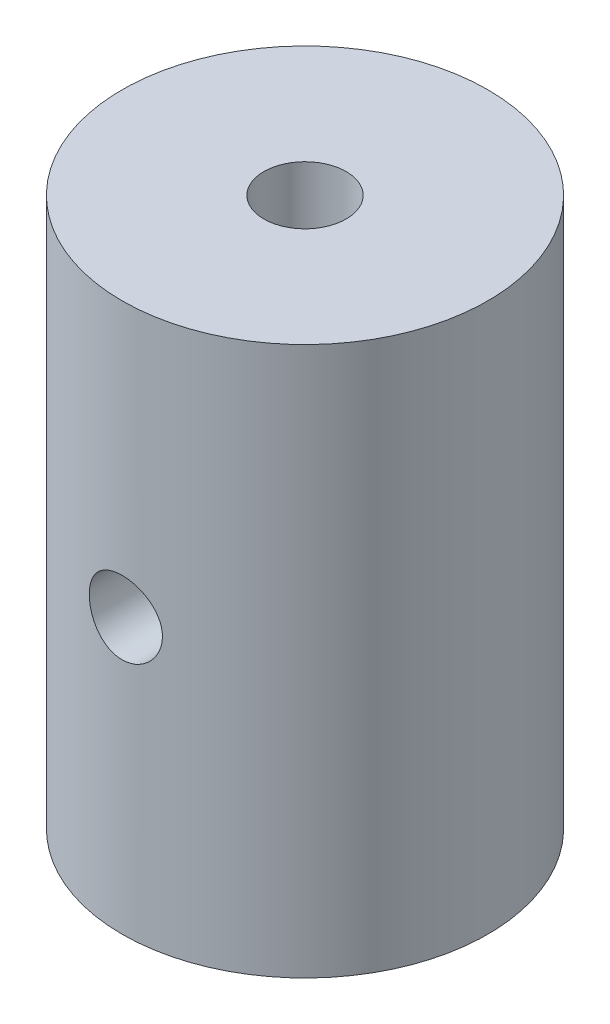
ISO-10303-21;
HEADER;
FILE_DESCRIPTION(('STEP AP214'),'2;1');
FILE_NAME('part.step','',(''),(''),'','','');
FILE_SCHEMA(('AUTOMOTIVE_DESIGN { 1 0 10303 214 1 1 1 1 }'));
ENDSEC;
DATA;
#1=APPLICATION_CONTEXT('core data for automotive mechanical design processes');
#2=APPLICATION_PROTOCOL_DEFINITION('international standard','automotive_design',2000,#1);
#3=PRODUCT_CONTEXT('',#1,'mechanical');
#4=PRODUCT('Part','Part','',(#3));
#5=PRODUCT_RELATED_PRODUCT_CATEGORY('part','',(#4));
#6=PRODUCT_DEFINITION_FORMATION('','',#4);
#7=PRODUCT_DEFINITION_CONTEXT('part definition',#1,'design');
#8=PRODUCT_DEFINITION('design','',#6,#7);
#9=PRODUCT_DEFINITION_SHAPE('','',#8);
#10=(LENGTH_UNIT() NAMED_UNIT(*) SI_UNIT(.MILLI.,.METRE.));
#11=(NAMED_UNIT(*) PLANE_ANGLE_UNIT() SI_UNIT($,.RADIAN.));
#12=(NAMED_UNIT(*) SI_UNIT($,.STERADIAN.) SOLID_ANGLE_UNIT());
#13=UNCERTAINTY_MEASURE_WITH_UNIT(LENGTH_MEASURE(1.E-05),#10,'distance_accuracy_value','');
#14=(GEOMETRIC_REPRESENTATION_CONTEXT(3) GLOBAL_UNCERTAINTY_ASSIGNED_CONTEXT((#13)) GLOBAL_UNIT_ASSIGNED_CONTEXT((#10,
#11,#12)) REPRESENTATION_CONTEXT('',''));
#15=CARTESIAN_POINT('',(0.,0.,0.));
#16=DIRECTION('',(0.,0.,1.));
#17=DIRECTION('',(1.,0.,0.));
#18=AXIS2_PLACEMENT_3D('',#15,#16,#17);
#19=CARTESIAN_POINT('',(0.,30.,0.));
#20=DIRECTION('',(0.,-1.,0.));
#21=DIRECTION('',(0.,0.,-1.));
#22=AXIS2_PLACEMENT_3D('',#19,#20,#21);
#23=CYLINDRICAL_SURFACE('',#22,10.);
#24=CARTESIAN_POINT('',(0.,16.65,-10.));
#25=CARTESIAN_POINT('',(-0.0920114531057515,16.6499962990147,-9.99999843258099));
#26=CARTESIAN_POINT('',(-0.184073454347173,16.6422775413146,-9.99871684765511));
#27=CARTESIAN_POINT('',(-0.36561632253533,16.6116187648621,-9.99372775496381));
#28=CARTESIAN_POINT('',(-0.455094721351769,16.5886646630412,-9.9900180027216));
#29=CARTESIAN_POINT('',(-0.628817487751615,16.5282463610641,-9.98058875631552));
#30=CARTESIAN_POINT('',(-0.713066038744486,16.4907939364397,-9.974870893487));
#31=CARTESIAN_POINT('',(-0.874072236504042,16.4024727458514,-9.96205444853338));
#32=CARTESIAN_POINT('',(-0.950830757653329,16.351605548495,-9.95495602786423));
#33=CARTESIAN_POINT('',(-1.09540879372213,16.2373912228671,-9.94009120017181));
#34=CARTESIAN_POINT('',(-1.16314787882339,16.1739429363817,-9.93231968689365));
#35=CARTESIAN_POINT('',(-1.28706950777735,16.0365852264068,-9.9170237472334));
#36=CARTESIAN_POINT('',(-1.34325132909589,15.9626751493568,-9.90949933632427));
#37=CARTESIAN_POINT('',(-1.44278500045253,15.8059406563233,-9.89550007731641));
#38=CARTESIAN_POINT('',(-1.48605749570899,15.7230652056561,-9.88903182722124));
#39=CARTESIAN_POINT('',(-1.55803674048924,15.5510973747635,-9.87794796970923));
#40=CARTESIAN_POINT('',(-1.58674445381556,15.4620054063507,-9.8733322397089));
#41=CARTESIAN_POINT('',(-1.6285261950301,15.280985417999,-9.86652679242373));
#42=CARTESIAN_POINT('',(-1.64173895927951,15.1890902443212,-9.86431555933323));
#43=CARTESIAN_POINT('',(-1.65258585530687,15.0043626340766,-9.86250435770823));
#44=CARTESIAN_POINT('',(-1.6502210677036,14.9115302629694,-9.86290420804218));
#45=CARTESIAN_POINT('',(-1.63009303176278,14.7285527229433,-9.86625034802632));
#46=CARTESIAN_POINT('',(-1.61248549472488,14.6383898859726,-9.86917088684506));
#47=CARTESIAN_POINT('',(-1.5626160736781,14.4623159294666,-9.87718903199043));
#48=CARTESIAN_POINT('',(-1.53035369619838,14.3764049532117,-9.88228671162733));
#49=CARTESIAN_POINT('',(-1.45193210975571,14.2108064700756,-9.89411264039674));
#50=CARTESIAN_POINT('',(-1.4057081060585,14.1311502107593,-9.90084846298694));
#51=CARTESIAN_POINT('',(-1.30072141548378,13.9806656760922,-9.9151864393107));
#52=CARTESIAN_POINT('',(-1.24195773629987,13.9098381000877,-9.92278866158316));
#53=CARTESIAN_POINT('',(-1.11271072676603,13.7781200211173,-9.93811607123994));
#54=CARTESIAN_POINT('',(-1.04209376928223,13.71736060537,-9.94584163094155));
#55=CARTESIAN_POINT('',(-0.891597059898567,13.6085339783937,-9.96045987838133));
#56=CARTESIAN_POINT('',(-0.811717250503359,13.5604668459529,-9.9673525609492));
#57=CARTESIAN_POINT('',(-0.644840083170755,13.4783778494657,-9.97953794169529));
#58=CARTESIAN_POINT('',(-0.55783700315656,13.444367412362,-9.98482933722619));
#59=CARTESIAN_POINT('',(-0.379246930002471,13.3914780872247,-9.99320544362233));
#60=CARTESIAN_POINT('',(-0.287660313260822,13.3725979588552,-9.99629033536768));
#61=CARTESIAN_POINT('',(-0.103632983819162,13.3506825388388,-9.99988156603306));
#62=CARTESIAN_POINT('',(-0.0112142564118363,13.3474672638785,-10.0004171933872));
#63=CARTESIAN_POINT('',(0.172841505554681,13.3564931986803,-9.99892971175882));
#64=CARTESIAN_POINT('',(0.264478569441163,13.3687338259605,-9.99690669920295));
#65=CARTESIAN_POINT('',(0.443814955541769,13.4081744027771,-9.99054737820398));
#66=CARTESIAN_POINT('',(0.531534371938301,13.4352853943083,-9.98622483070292));
#67=CARTESIAN_POINT('',(0.701182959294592,13.5036023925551,-9.97574921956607));
#68=CARTESIAN_POINT('',(0.783111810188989,13.5448091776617,-9.96959605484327));
#69=CARTESIAN_POINT('',(0.939636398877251,13.640561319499,-9.95606928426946));
#70=CARTESIAN_POINT('',(1.01416235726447,13.6952192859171,-9.94868555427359));
#71=CARTESIAN_POINT('',(1.15304841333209,13.8161671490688,-9.93354765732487));
#72=CARTESIAN_POINT('',(1.21740778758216,13.8824578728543,-9.92579346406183));
#73=CARTESIAN_POINT('',(1.33479962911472,14.0255961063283,-9.91069407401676));
#74=CARTESIAN_POINT('',(1.38771058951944,14.1025438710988,-9.90335382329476));
#75=CARTESIAN_POINT('',(1.47985547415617,14.2643410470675,-9.89000528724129));
#76=CARTESIAN_POINT('',(1.51908982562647,14.3491902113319,-9.88399696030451));
#77=CARTESIAN_POINT('',(1.58258535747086,14.5240395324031,-9.87402953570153));
#78=CARTESIAN_POINT('',(1.60690737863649,14.6140170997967,-9.87006212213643));
#79=CARTESIAN_POINT('',(1.64007952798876,14.7968513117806,-9.86460473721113));
#80=CARTESIAN_POINT('',(1.64893097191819,14.8897077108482,-9.86311455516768));
#81=CARTESIAN_POINT('',(1.65087457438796,15.0744506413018,-9.86278931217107));
#82=CARTESIAN_POINT('',(1.64415796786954,15.1663351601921,-9.86392203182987));
#83=CARTESIAN_POINT('',(1.61556925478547,15.3476477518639,-9.86864441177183));
#84=CARTESIAN_POINT('',(1.59369719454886,15.4370758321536,-9.87223406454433));
#85=CARTESIAN_POINT('',(1.53549112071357,15.6108652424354,-9.88145370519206));
#86=CARTESIAN_POINT('',(1.49917324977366,15.695232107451,-9.88708141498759));
#87=CARTESIAN_POINT('',(1.41312606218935,15.8567062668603,-9.89974533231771));
#88=CARTESIAN_POINT('',(1.36339610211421,15.9338132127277,-9.90678160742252));
#89=CARTESIAN_POINT('',(1.25125259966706,16.0795454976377,-9.92157214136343));
#90=CARTESIAN_POINT('',(1.18869826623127,16.1480617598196,-9.92933379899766));
#91=CARTESIAN_POINT('',(1.0529786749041,16.2736905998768,-9.94464125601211));
#92=CARTESIAN_POINT('',(0.979810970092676,16.3308005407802,-9.95218700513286));
#93=CARTESIAN_POINT('',(0.824354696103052,16.4323474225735,-9.96627143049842));
#94=CARTESIAN_POINT('',(0.742007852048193,16.476696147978,-9.97280295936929));
#95=CARTESIAN_POINT('',(0.5709595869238,16.5508633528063,-9.98405342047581));
#96=CARTESIAN_POINT('',(0.482264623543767,16.5806963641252,-9.98877416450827));
#97=CARTESIAN_POINT('',(0.327682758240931,16.6184793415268,-9.99483601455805));
#98=CARTESIAN_POINT('',(0.262733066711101,16.6302807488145,-9.99676220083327));
#99=CARTESIAN_POINT('',(0.131864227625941,16.6460423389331,-9.99934474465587));
#100=CARTESIAN_POINT('',(0.0659450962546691,16.6500026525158,-10.0000011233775));
#101=CARTESIAN_POINT('',(0.,16.65,-10.));
#102=B_SPLINE_CURVE_WITH_KNOTS('',3,(#24,#25,#26,#27,#28,#29,#30,#31,#32,#33,#34,#35,#36,#37,
#38,#39,#40,#41,#42,#43,#44,#45,#46,#47,#48,#49,#50,#51,#52,#53,#54,#55,#56,#57,#58,#59,#60,#61,
#62,#63,#64,#65,#66,#67,#68,#69,#70,#71,#72,#73,#74,#75,#76,#77,#78,#79,#80,#81,#82,#83,#84,#85,
#86,#87,#88,#89,#90,#91,#92,#93,#94,#95,#96,#97,#98,#99,#100,#101),.UNSPECIFIED.,.T.,.F.,(4,2,2,
2,2,2,2,2,2,2,2,2,2,2,2,2,2,2,2,2,2,2,2,2,2,2,2,2,2,2,2,2,2,2,2,2,2,2,4),(0.,0.275793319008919,
0.551841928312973,0.827666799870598,1.10345943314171,1.38156673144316,1.65969141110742,
1.93949209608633,2.21927426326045,2.49653175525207,2.7737700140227,3.04820914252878,
3.32265751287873,3.59839967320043,3.87416366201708,4.15327572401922,4.43238951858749,
4.71172976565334,4.99104711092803,5.26714751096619,5.54323750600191,5.81769359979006,
6.09216485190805,6.36901711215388,6.6458890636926,6.92556925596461,7.2052407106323,
7.48376340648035,7.76226241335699,8.03735855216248,8.31245385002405,8.58724259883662,
8.86204453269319,9.1400425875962,9.41810483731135,9.69804546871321,9.97770526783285,
10.1753710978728,10.3730336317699),.UNSPECIFIED.);
#103=CARTESIAN_POINT('',(0.,16.65,-10.));
#104=VERTEX_POINT('',#103);
#105=EDGE_CURVE('E58',#104,#104,#102,.T.);
#106=ORIENTED_EDGE('',*,*,#105,.T.);
#107=EDGE_LOOP('',(#106));
#108=FACE_BOUND('',#107,.T.);
#109=CARTESIAN_POINT('',(0.,0.,0.));
#110=DIRECTION('',(0.,1.,0.));
#111=DIRECTION('',(0.,0.,1.));
#112=AXIS2_PLACEMENT_3D('',#109,#110,#111);
#113=CIRCLE('',#112,10.);
#114=CARTESIAN_POINT('',(0.,0.,10.));
#115=VERTEX_POINT('',#114);
#116=EDGE_CURVE('E44',#115,#115,#113,.T.);
#117=ORIENTED_EDGE('',*,*,#116,.T.);
#118=EDGE_LOOP('',(#117));
#119=FACE_BOUND('',#118,.T.);
#120=CARTESIAN_POINT('',(0.,30.,0.));
#121=DIRECTION('',(0.,1.,0.));
#122=DIRECTION('',(0.,0.,1.));
#123=AXIS2_PLACEMENT_3D('',#120,#121,#122);
#124=CIRCLE('',#123,10.);
#125=CARTESIAN_POINT('',(0.,30.,10.));
#126=VERTEX_POINT('',#125);
#127=EDGE_CURVE('E10',#126,#126,#124,.T.);
#128=ORIENTED_EDGE('',*,*,#127,.F.);
#129=EDGE_LOOP('',(#128));
#130=FACE_BOUND('',#129,.T.);
#131=CARTESIAN_POINT('',(-2.,15.,9.79795897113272));
#132=CARTESIAN_POINT('',(-1.99999589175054,14.8888712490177,9.79796118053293));
#133=CARTESIAN_POINT('',(-1.99070634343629,14.7776907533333,9.79987016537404));
#134=CARTESIAN_POINT('',(-1.95382456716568,14.5584749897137,9.8072886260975));
#135=CARTESIAN_POINT('',(-1.92621769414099,14.450442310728,9.81280098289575));
#136=CARTESIAN_POINT('',(-1.85359156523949,14.2407253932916,9.82677747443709));
#137=CARTESIAN_POINT('',(-1.80858962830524,14.1390349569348,9.83523867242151));
#138=CARTESIAN_POINT('',(-1.70249821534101,13.9446503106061,9.85415598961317));
#139=CARTESIAN_POINT('',(-1.6414096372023,13.8519555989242,9.86461199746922));
#140=CARTESIAN_POINT('',(-1.50395815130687,13.6768779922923,9.88650599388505));
#141=CARTESIAN_POINT('',(-1.42741131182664,13.5946408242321,9.89795475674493));
#142=CARTESIAN_POINT('',(-1.26161357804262,13.444084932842,9.92044944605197));
#143=CARTESIAN_POINT('',(-1.17236179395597,13.3757671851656,9.93149534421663));
#144=CARTESIAN_POINT('',(-0.982722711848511,13.2544239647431,9.95205592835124));
#145=CARTESIAN_POINT('',(-0.882245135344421,13.2015369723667,9.96155642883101));
#146=CARTESIAN_POINT('',(-0.673608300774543,13.1134501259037,9.97783473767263));
#147=CARTESIAN_POINT('',(-0.565449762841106,13.078248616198,9.98461280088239));
#148=CARTESIAN_POINT('',(-0.346033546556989,13.0269856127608,9.99460641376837));
#149=CARTESIAN_POINT('',(-0.234835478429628,13.010678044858,9.99786772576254));
#150=CARTESIAN_POINT('',(-0.0112371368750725,12.9968980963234,10.0006184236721));
#151=CARTESIAN_POINT('',(0.101163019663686,12.9994239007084,10.0001081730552));
#152=CARTESIAN_POINT('',(0.322284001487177,13.0230523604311,9.99540869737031));
#153=CARTESIAN_POINT('',(0.43103442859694,13.0438899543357,9.99127196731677));
#154=CARTESIAN_POINT('',(0.643463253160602,13.1031300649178,9.97984354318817));
#155=CARTESIAN_POINT('',(0.747141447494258,13.1415332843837,9.97255172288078));
#156=CARTESIAN_POINT('',(0.947238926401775,13.2350600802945,9.95554592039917));
#157=CARTESIAN_POINT('',(1.0436083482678,13.2902875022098,9.94581696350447));
#158=CARTESIAN_POINT('',(1.22581009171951,13.4158181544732,9.92500938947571));
#159=CARTESIAN_POINT('',(1.31164119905,13.486123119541,9.91393061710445));
#160=CARTESIAN_POINT('',(1.47190286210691,13.6412672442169,9.89141928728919));
#161=CARTESIAN_POINT('',(1.54610863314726,13.7263383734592,9.87998392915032));
#162=CARTESIAN_POINT('',(1.67923698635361,13.9078328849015,9.85823143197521));
#163=CARTESIAN_POINT('',(1.7381592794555,14.0042564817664,9.84791431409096));
#164=CARTESIAN_POINT('',(1.83912562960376,14.2060416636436,9.82956094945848));
#165=CARTESIAN_POINT('',(1.88113329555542,14.3114219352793,9.82152963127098));
#166=CARTESIAN_POINT('',(1.94678068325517,14.527942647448,9.80872952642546));
#167=CARTESIAN_POINT('',(1.97042279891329,14.6390823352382,9.80396031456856));
#168=CARTESIAN_POINT('',(1.9983320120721,14.8619297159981,9.79830958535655));
#169=CARTESIAN_POINT('',(2.00292371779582,14.9735951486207,9.79736294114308));
#170=CARTESIAN_POINT('',(1.99347525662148,15.1960964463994,9.79928971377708));
#171=CARTESIAN_POINT('',(1.97943614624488,15.3069323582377,9.80216291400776));
#172=CARTESIAN_POINT('',(1.93340441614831,15.5235372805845,9.8113446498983));
#173=CARTESIAN_POINT('',(1.9015852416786,15.6293446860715,9.81761998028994));
#174=CARTESIAN_POINT('',(1.82108207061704,15.8341265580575,9.8328697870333));
#175=CARTESIAN_POINT('',(1.77239668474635,15.9331004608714,9.84184448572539));
#176=CARTESIAN_POINT('',(1.6588082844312,16.1228262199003,9.86162811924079));
#177=CARTESIAN_POINT('',(1.59370215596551,16.2134540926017,9.87245943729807));
#178=CARTESIAN_POINT('',(1.44939114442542,16.3826166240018,9.89467447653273));
#179=CARTESIAN_POINT('',(1.37018481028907,16.4611500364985,9.90605825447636));
#180=CARTESIAN_POINT('',(1.19846454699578,16.6051251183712,9.92830691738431));
#181=CARTESIAN_POINT('',(1.10576499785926,16.6703473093,9.93916115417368));
#182=CARTESIAN_POINT('',(0.910535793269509,16.7842917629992,9.9589425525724));
#183=CARTESIAN_POINT('',(0.808006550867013,16.8330147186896,9.96786979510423));
#184=CARTESIAN_POINT('',(0.596605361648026,16.9122577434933,9.98274588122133));
#185=CARTESIAN_POINT('',(0.487773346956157,16.9428810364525,9.98871158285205));
#186=CARTESIAN_POINT('',(0.266378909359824,16.9853824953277,9.99706471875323));
#187=CARTESIAN_POINT('',(0.153816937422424,16.9972629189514,9.99945258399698));
#188=CARTESIAN_POINT('',(-0.0697457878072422,17.0018539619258,10.0003708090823));
#189=CARTESIAN_POINT('',(-0.180739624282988,16.9948945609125,9.99896757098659));
#190=CARTESIAN_POINT('',(-0.3999420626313,16.9627320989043,9.99260087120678));
#191=CARTESIAN_POINT('',(-0.508150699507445,16.9375292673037,9.98763745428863));
#192=CARTESIAN_POINT('',(-0.71850549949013,16.8697420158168,9.97470996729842));
#193=CARTESIAN_POINT('',(-0.820664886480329,16.827197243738,9.9667527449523));
#194=CARTESIAN_POINT('',(-1.01644244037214,16.7259755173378,9.9486944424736));
#195=CARTESIAN_POINT('',(-1.11005993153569,16.667297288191,9.93859319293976));
#196=CARTESIAN_POINT('',(-1.28772778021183,16.5343612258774,9.91715198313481));
#197=CARTESIAN_POINT('',(-1.37159943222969,16.4598673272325,9.90579466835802));
#198=CARTESIAN_POINT('',(-1.52576523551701,16.2978995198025,9.8832244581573));
#199=CARTESIAN_POINT('',(-1.59605616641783,16.2104225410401,9.87201159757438));
#200=CARTESIAN_POINT('',(-1.72178443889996,16.0238413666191,9.85086685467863));
#201=CARTESIAN_POINT('',(-1.77705362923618,15.9246220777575,9.84095007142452));
#202=CARTESIAN_POINT('',(-1.87004809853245,15.7181344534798,9.82370474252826));
#203=CARTESIAN_POINT('',(-1.90778929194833,15.6108735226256,9.81637385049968));
#204=CARTESIAN_POINT('',(-1.95733827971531,15.4194750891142,9.8065936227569));
#205=CARTESIAN_POINT('',(-1.97330779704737,15.3364291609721,9.80337569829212));
#206=CARTESIAN_POINT('',(-1.99464003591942,15.1689320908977,9.79905756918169));
#207=CARTESIAN_POINT('',(-2.00000312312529,15.0844809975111,9.79795729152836));
#208=CARTESIAN_POINT('',(-2.,15.,9.79795897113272));
#209=B_SPLINE_CURVE_WITH_KNOTS('',3,(#131,#132,#133,#134,#135,#136,#137,#138,#139,#140,#141,
#142,#143,#144,#145,#146,#147,#148,#149,#150,#151,#152,#153,#154,#155,#156,#157,#158,#159,#160,
#161,#162,#163,#164,#165,#166,#167,#168,#169,#170,#171,#172,#173,#174,#175,#176,#177,#178,#179,
#180,#181,#182,#183,#184,#185,#186,#187,#188,#189,#190,#191,#192,#193,#194,#195,#196,#197,#198,
#199,#200,#201,#202,#203,#204,#205,#206,#207,#208),.UNSPECIFIED.,.T.,.F.,(4,2,2,2,2,2,2,2,2,2,2,
2,2,2,2,2,2,2,2,2,2,2,2,2,2,2,2,2,2,2,2,2,2,2,2,2,2,2,4),(0.,0.333076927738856,
0.666420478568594,0.999432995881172,1.33242692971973,1.66964505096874,2.00688680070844,
2.347068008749,2.6872173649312,3.02288497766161,3.35852024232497,3.68937579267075,
4.02024458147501,4.35319848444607,4.68619071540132,5.02498693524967,5.36378956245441,
5.70331726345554,6.0428007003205,6.37647515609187,6.71013069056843,7.04058683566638,
7.37107020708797,7.70586119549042,8.04068665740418,8.38065203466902,8.7206031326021,
9.05859627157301,9.39654869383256,9.72862034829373,10.0606878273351,10.392000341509,
10.7233390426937,11.0600230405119,11.3967867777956,11.7371779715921,12.077259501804,
12.3304760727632,12.5836839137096),.UNSPECIFIED.);
#210=CARTESIAN_POINT('',(-2.,15.,9.79795897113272));
#211=VERTEX_POINT('',#210);
#212=EDGE_CURVE('E57',#211,#211,#209,.T.);
#213=ORIENTED_EDGE('',*,*,#212,.F.);
#214=EDGE_LOOP('',(#213));
#215=FACE_BOUND('',#214,.T.);
#216=ADVANCED_FACE('F32',(#108,#119,#130,#215),#23,.T.);
#217=CARTESIAN_POINT('',(0.,30.,0.));
#218=DIRECTION('',(0.,-1.,0.));
#219=DIRECTION('',(0.,0.,-1.));
#220=AXIS2_PLACEMENT_3D('',#217,#218,#219);
#221=CYLINDRICAL_SURFACE('',#220,2.25);
#222=CARTESIAN_POINT('',(0.,16.65,-2.25));
#223=CARTESIAN_POINT('',(-0.0809906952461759,16.6499947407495,-2.24999497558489));
#224=CARTESIAN_POINT('',(-0.162113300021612,16.6439889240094,-2.24558051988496));
#225=CARTESIAN_POINT('',(-0.321821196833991,16.6203345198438,-2.22832242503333));
#226=CARTESIAN_POINT('',(-0.40039958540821,16.6026566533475,-2.21545758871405));
#227=CARTESIAN_POINT('',(-0.552282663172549,16.5568364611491,-2.18254158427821));
#228=CARTESIAN_POINT('',(-0.625615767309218,16.5287565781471,-2.16253332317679));
#229=CARTESIAN_POINT('',(-0.766073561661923,16.4634333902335,-2.11685925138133));
#230=CARTESIAN_POINT('',(-0.83320009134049,16.4261928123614,-2.09119512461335));
#231=CARTESIAN_POINT('',(-0.966336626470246,16.339980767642,-2.03333001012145));
#232=CARTESIAN_POINT('',(-1.03168378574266,16.2902481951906,-2.00074594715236));
#233=CARTESIAN_POINT('',(-1.1536800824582,16.1824395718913,-1.93297808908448));
#234=CARTESIAN_POINT('',(-1.21031529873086,16.1243504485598,-1.89779026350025));
#235=CARTESIAN_POINT('',(-1.32459682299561,15.9885794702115,-1.82032286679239));
#236=CARTESIAN_POINT('',(-1.38030211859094,15.9092836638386,-1.77799359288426));
#237=CARTESIAN_POINT('',(-1.47774307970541,15.7404368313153,-1.69786280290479));
#238=CARTESIAN_POINT('',(-1.51949951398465,15.650901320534,-1.66005460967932));
#239=CARTESIAN_POINT('',(-1.57581948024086,15.4937054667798,-1.60632390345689));
#240=CARTESIAN_POINT('',(-1.59480769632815,15.4287025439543,-1.58730714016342));
#241=CARTESIAN_POINT('',(-1.62479877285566,15.2952686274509,-1.556597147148));
#242=CARTESIAN_POINT('',(-1.63581957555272,15.2268457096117,-1.5448874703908));
#243=CARTESIAN_POINT('',(-1.64916354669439,15.087615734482,-1.53064273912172));
#244=CARTESIAN_POINT('',(-1.65141915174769,15.0167943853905,-1.52817895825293));
#245=CARTESIAN_POINT('',(-1.64683173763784,14.8757761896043,-1.53311832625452));
#246=CARTESIAN_POINT('',(-1.63998250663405,14.805579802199,-1.54052821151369));
#247=CARTESIAN_POINT('',(-1.61656395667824,14.6605997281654,-1.56509666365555));
#248=CARTESIAN_POINT('',(-1.59901909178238,14.5861466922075,-1.58322726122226));
#249=CARTESIAN_POINT('',(-1.55470669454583,14.442249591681,-1.62675928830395));
#250=CARTESIAN_POINT('',(-1.52791741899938,14.3728178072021,-1.6521778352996));
#251=CARTESIAN_POINT('',(-1.45534248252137,14.2162162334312,-1.71685192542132));
#252=CARTESIAN_POINT('',(-1.40618988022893,14.1313305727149,-1.75783830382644));
#253=CARTESIAN_POINT('',(-1.2943473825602,13.9720675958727,-1.84175869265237));
#254=CARTESIAN_POINT('',(-1.23164206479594,13.8977024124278,-1.88469487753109));
#255=CARTESIAN_POINT('',(-1.09236217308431,13.7594348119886,-1.96874589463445));
#256=CARTESIAN_POINT('',(-1.01560526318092,13.6956939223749,-2.00982669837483));
#257=CARTESIAN_POINT('',(-0.849681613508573,13.5820450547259,-2.08537843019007));
#258=CARTESIAN_POINT('',(-0.760543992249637,13.5321054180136,-2.11986442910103));
#259=CARTESIAN_POINT('',(-0.59589989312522,13.4594473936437,-2.17090376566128));
#260=CARTESIAN_POINT('',(-0.522743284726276,13.4330333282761,-2.18978777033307));
#261=CARTESIAN_POINT('',(-0.372031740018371,13.3905885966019,-2.22035708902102));
#262=CARTESIAN_POINT('',(-0.294480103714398,13.3745502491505,-2.23204772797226));
#263=CARTESIAN_POINT('',(-0.136757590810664,13.3537477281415,-2.24724173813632));
#264=CARTESIAN_POINT('',(-0.0565777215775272,13.3490275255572,-2.25071317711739));
#265=CARTESIAN_POINT('',(0.103527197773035,13.351306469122,-2.24904189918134));
#266=CARTESIAN_POINT('',(0.183452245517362,13.3583057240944,-2.24389910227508));
#267=CARTESIAN_POINT('',(0.335727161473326,13.3827872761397,-2.22605327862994));
#268=CARTESIAN_POINT('',(0.408242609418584,13.3996087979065,-2.21382714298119));
#269=CARTESIAN_POINT('',(0.549140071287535,13.4423192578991,-2.18315118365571));
#270=CARTESIAN_POINT('',(0.617521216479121,13.4682100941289,-2.16470005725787));
#271=CARTESIAN_POINT('',(0.754234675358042,13.5304036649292,-2.12112731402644));
#272=CARTESIAN_POINT('',(0.822129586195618,13.5673712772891,-2.09559155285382));
#273=CARTESIAN_POINT('',(0.950949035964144,13.6494305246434,-2.04037172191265));
#274=CARTESIAN_POINT('',(1.01186922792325,13.6945271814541,-2.01068509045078));
#275=CARTESIAN_POINT('',(1.13679320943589,13.8007890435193,-1.94322308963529));
#276=CARTESIAN_POINT('',(1.1993175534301,13.8633844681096,-1.90496217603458));
#277=CARTESIAN_POINT('',(1.31359376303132,13.9976258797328,-1.8280361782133));
#278=CARTESIAN_POINT('',(1.36533563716,14.0692801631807,-1.78937075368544));
#279=CARTESIAN_POINT('',(1.45267281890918,14.2134811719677,-1.71902835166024));
#280=CARTESIAN_POINT('',(1.48937197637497,14.2852044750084,-1.68704009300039));
#281=CARTESIAN_POINT('',(1.55248896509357,14.4353104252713,-1.62914476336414));
#282=CARTESIAN_POINT('',(1.57892817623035,14.5136788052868,-1.60322509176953));
#283=CARTESIAN_POINT('',(1.61533068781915,14.6574160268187,-1.56643591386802));
#284=CARTESIAN_POINT('',(1.62768458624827,14.7216302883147,-1.5534761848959));
#285=CARTESIAN_POINT('',(1.64467218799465,14.8521289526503,-1.53548498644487));
#286=CARTESIAN_POINT('',(1.64931772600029,14.9184100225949,-1.5304413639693));
#287=CARTESIAN_POINT('',(1.65054319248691,15.0512925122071,-1.52912035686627));
#288=CARTESIAN_POINT('',(1.6471045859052,15.1178943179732,-1.53286311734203));
#289=CARTESIAN_POINT('',(1.63240565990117,15.249274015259,-1.54850224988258));
#290=CARTESIAN_POINT('',(1.62113461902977,15.3140492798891,-1.56040979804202));
#291=CARTESIAN_POINT('',(1.58722765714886,15.4584526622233,-1.59497351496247));
#292=CARTESIAN_POINT('',(1.56226024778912,15.5370164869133,-1.61973224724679));
#293=CARTESIAN_POINT('',(1.50206530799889,15.6876912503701,-1.67570533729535));
#294=CARTESIAN_POINT('',(1.4668108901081,15.7597846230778,-1.70693654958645));
#295=CARTESIAN_POINT('',(1.37621669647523,15.9158229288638,-1.78124164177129));
#296=CARTESIAN_POINT('',(1.31802258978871,15.9976760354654,-1.82522955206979));
#297=CARTESIAN_POINT('',(1.18771158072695,16.1497168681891,-1.91259016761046));
#298=CARTESIAN_POINT('',(1.11560276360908,16.2199113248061,-1.95596321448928));
#299=CARTESIAN_POINT('',(0.970486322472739,16.3371352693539,-2.03131946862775));
#300=CARTESIAN_POINT('',(0.899396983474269,16.386071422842,-2.06402180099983));
#301=CARTESIAN_POINT('',(0.748509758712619,16.4730199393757,-2.12338830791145));
#302=CARTESIAN_POINT('',(0.66872093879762,16.5110435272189,-2.15005868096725));
#303=CARTESIAN_POINT('',(0.514488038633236,16.5695720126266,-2.19162068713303));
#304=CARTESIAN_POINT('',(0.441029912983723,16.5918466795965,-2.20767749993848));
#305=CARTESIAN_POINT('',(0.290634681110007,16.6260201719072,-2.23244266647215));
#306=CARTESIAN_POINT('',(0.213707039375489,16.6379456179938,-2.24116987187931));
#307=CARTESIAN_POINT('',(0.113564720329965,16.6462449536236,-2.24724766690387));
#308=CARTESIAN_POINT('',(0.0908909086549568,16.647651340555,-2.24827811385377));
#309=CARTESIAN_POINT('',(0.0454815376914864,16.6495296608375,-2.24965502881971));
#310=CARTESIAN_POINT('',(0.0227459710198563,16.6500014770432,-2.2500014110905));
#311=CARTESIAN_POINT('',(0.,16.65,-2.25));
#312=B_SPLINE_CURVE_WITH_KNOTS('',3,(#222,#223,#224,#225,#226,#227,#228,#229,#230,#231,#232,
#233,#234,#235,#236,#237,#238,#239,#240,#241,#242,#243,#244,#245,#246,#247,#248,#249,#250,#251,
#252,#253,#254,#255,#256,#257,#258,#259,#260,#261,#262,#263,#264,#265,#266,#267,#268,#269,#270,
#271,#272,#273,#274,#275,#276,#277,#278,#279,#280,#281,#282,#283,#284,#285,#286,#287,#288,#289,
#290,#291,#292,#293,#294,#295,#296,#297,#298,#299,#300,#301,#302,#303,#304,#305,#306,#307,#308,
#309,#310,#311),.UNSPECIFIED.,.T.,.F.,(4,2,2,2,2,2,2,2,2,2,2,2,2,2,2,2,2,2,2,2,2,2,2,2,2,2,2,2,
2,2,2,2,2,2,2,2,2,2,2,2,2,2,2,2,4),(0.,0.242872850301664,0.48635726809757,0.728403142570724,
0.970377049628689,1.23446779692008,1.49897625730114,1.81487048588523,2.13029225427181,
2.34056715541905,2.55036703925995,2.76178091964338,2.9733391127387,3.20789113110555,
3.44299862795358,3.76029490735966,4.07795417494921,4.40007264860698,4.72144596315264,
4.96057061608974,5.19951804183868,5.43939228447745,5.67926875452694,5.9046129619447,
6.13000435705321,6.37334189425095,6.61683027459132,6.90492246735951,7.19328044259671,
7.45247037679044,7.71111726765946,7.91028899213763,8.10915464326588,8.30847669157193,
8.50807212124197,8.76487616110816,9.02235752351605,9.34970128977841,9.67685541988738,
9.95264965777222,10.228159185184,10.4624548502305,10.6961460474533,10.7643475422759,
10.8325575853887),.UNSPECIFIED.);
#313=CARTESIAN_POINT('',(0.,16.65,-2.25));
#314=VERTEX_POINT('',#313);
#315=EDGE_CURVE('E36',#314,#314,#312,.T.);
#316=ORIENTED_EDGE('',*,*,#315,.F.);
#317=EDGE_LOOP('',(#316));
#318=FACE_BOUND('',#317,.T.);
#319=CARTESIAN_POINT('',(0.,0.,0.));
#320=DIRECTION('',(0.,1.,0.));
#321=DIRECTION('',(0.,0.,1.));
#322=AXIS2_PLACEMENT_3D('',#319,#320,#321);
#323=CIRCLE('',#322,2.25);
#324=CARTESIAN_POINT('',(0.,0.,2.25));
#325=VERTEX_POINT('',#324);
#326=EDGE_CURVE('E76',#325,#325,#323,.T.);
#327=ORIENTED_EDGE('',*,*,#326,.F.);
#328=EDGE_LOOP('',(#327));
#329=FACE_BOUND('',#328,.T.);
#330=CARTESIAN_POINT('',(0.,30.,0.));
#331=DIRECTION('',(0.,1.,0.));
#332=DIRECTION('',(0.,0.,1.));
#333=AXIS2_PLACEMENT_3D('',#330,#331,#332);
#334=CIRCLE('',#333,2.25);
#335=CARTESIAN_POINT('',(0.,30.,2.25));
#336=VERTEX_POINT('',#335);
#337=EDGE_CURVE('E49',#336,#336,#334,.T.);
#338=ORIENTED_EDGE('',*,*,#337,.T.);
#339=EDGE_LOOP('',(#338));
#340=FACE_BOUND('',#339,.T.);
#341=CARTESIAN_POINT('',(-2.,15.,1.03077640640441));
#342=CARTESIAN_POINT('',(-1.99999703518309,14.9380289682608,1.03078586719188));
#343=CARTESIAN_POINT('',(-1.99708210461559,14.8760391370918,1.0364957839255));
#344=CARTESIAN_POINT('',(-1.98579706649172,14.754266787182,1.05794290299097));
#345=CARTESIAN_POINT('',(-1.97740827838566,14.6944925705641,1.07371443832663));
#346=CARTESIAN_POINT('',(-1.95094237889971,14.5513017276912,1.12131401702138));
#347=CARTESIAN_POINT('',(-1.93017550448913,14.4697917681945,1.15719706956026));
#348=CARTESIAN_POINT('',(-1.88023495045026,14.313338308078,1.23670608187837));
#349=CARTESIAN_POINT('',(-1.85102876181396,14.238421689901,1.2803617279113));
#350=CARTESIAN_POINT('',(-1.79064126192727,14.1067564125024,1.36318302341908));
#351=CARTESIAN_POINT('',(-1.76067563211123,14.049106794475,1.40181898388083));
#352=CARTESIAN_POINT('',(-1.69558094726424,13.9373663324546,1.4798976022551));
#353=CARTESIAN_POINT('',(-1.66044885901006,13.8832776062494,1.5193407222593));
#354=CARTESIAN_POINT('',(-1.54737423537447,13.7263194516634,1.63704614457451));
#355=CARTESIAN_POINT('',(-1.46163019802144,13.6284911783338,1.71486446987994));
#356=CARTESIAN_POINT('',(-1.29187162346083,13.469919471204,1.84449306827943));
#357=CARTESIAN_POINT('',(-1.21227280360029,13.4058841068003,1.89809362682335));
#358=CARTESIAN_POINT('',(-1.04078068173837,13.2890061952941,1.99725618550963));
#359=CARTESIAN_POINT('',(-0.948908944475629,13.2361444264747,2.04283196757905));
#360=CARTESIAN_POINT('',(-0.772604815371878,13.1532020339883,2.11490739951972));
#361=CARTESIAN_POINT('',(-0.690131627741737,13.1206960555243,2.14338960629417));
#362=CARTESIAN_POINT('',(-0.51913378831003,13.0664733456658,2.19108581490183));
#363=CARTESIAN_POINT('',(-0.430612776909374,13.0447501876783,2.2103053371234));
#364=CARTESIAN_POINT('',(-0.249241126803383,13.0134483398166,2.2380425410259));
#365=CARTESIAN_POINT('',(-0.156368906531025,13.0039387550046,2.24649932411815));
#366=CARTESIAN_POINT('',(0.0301150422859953,12.998054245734,2.2517292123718));
#367=CARTESIAN_POINT('',(0.123726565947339,13.0016758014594,2.24850544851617));
#368=CARTESIAN_POINT('',(0.299919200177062,13.0208132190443,2.23151610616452));
#369=CARTESIAN_POINT('',(0.382724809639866,13.0352082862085,2.21874399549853));
#370=CARTESIAN_POINT('',(0.54422394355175,13.073677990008,2.18475075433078));
#371=CARTESIAN_POINT('',(0.622916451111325,13.097755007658,2.16352754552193));
#372=CARTESIAN_POINT('',(0.779406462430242,13.1561115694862,2.11239513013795));
#373=CARTESIAN_POINT('',(0.856853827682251,13.1909257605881,2.08203346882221));
#374=CARTESIAN_POINT('',(1.00454592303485,13.2685670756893,2.01493992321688));
#375=CARTESIAN_POINT('',(1.07478907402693,13.3113959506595,1.97820664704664));
#376=CARTESIAN_POINT('',(1.24253243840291,13.4279578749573,1.87946454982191));
#377=CARTESIAN_POINT('',(1.33510978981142,13.5061494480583,1.81427422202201));
#378=CARTESIAN_POINT('',(1.46093910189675,13.6328028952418,1.71204950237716));
#379=CARTESIAN_POINT('',(1.50080058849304,13.6767150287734,1.67713289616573));
#380=CARTESIAN_POINT('',(1.57619642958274,13.7674897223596,1.60647630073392));
#381=CARTESIAN_POINT('',(1.61173247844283,13.8143511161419,1.57073664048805));
#382=CARTESIAN_POINT('',(1.67931572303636,13.9121045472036,1.49830280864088));
#383=CARTESIAN_POINT('',(1.71125937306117,13.9630661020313,1.46160621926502));
#384=CARTESIAN_POINT('',(1.77068307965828,14.0681584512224,1.38902121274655));
#385=CARTESIAN_POINT('',(1.79815969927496,14.1222916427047,1.35313343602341));
#386=CARTESIAN_POINT('',(1.84838179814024,14.2337086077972,1.28367053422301));
#387=CARTESIAN_POINT('',(1.87115054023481,14.2909750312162,1.25008461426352));
#388=CARTESIAN_POINT('',(1.91179828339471,14.4092949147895,1.18698293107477));
#389=CARTESIAN_POINT('',(1.92968640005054,14.4703410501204,1.15745963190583));
#390=CARTESIAN_POINT('',(1.95767968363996,14.5870639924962,1.10934525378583));
#391=CARTESIAN_POINT('',(1.96855616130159,14.6421375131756,1.08977326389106));
#392=CARTESIAN_POINT('',(1.98575198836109,14.7549966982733,1.05812035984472));
#393=CARTESIAN_POINT('',(1.99208635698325,14.812772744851,1.04601477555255));
#394=CARTESIAN_POINT('',(1.99967348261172,14.9306079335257,1.03144849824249));
#395=CARTESIAN_POINT('',(2.00086852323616,14.990685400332,1.02909736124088));
#396=CARTESIAN_POINT('',(1.9978584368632,15.1102240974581,1.03492363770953));
#397=CARTESIAN_POINT('',(1.99364618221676,15.1696844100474,1.04311494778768));
#398=CARTESIAN_POINT('',(1.97892707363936,15.2980906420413,1.07080686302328));
#399=CARTESIAN_POINT('',(1.9672983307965,15.3664542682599,1.0922964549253));
#400=CARTESIAN_POINT('',(1.93800807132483,15.4987521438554,1.14345439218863));
#401=CARTESIAN_POINT('',(1.92032351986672,15.5626683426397,1.17315388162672));
#402=CARTESIAN_POINT('',(1.88153280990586,15.6806836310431,1.23431348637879));
#403=CARTESIAN_POINT('',(1.86088027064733,15.7351479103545,1.26537196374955));
#404=CARTESIAN_POINT('',(1.81549092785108,15.8410166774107,1.32968002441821));
#405=CARTESIAN_POINT('',(1.79075097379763,15.8924187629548,1.36293128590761));
#406=CARTESIAN_POINT('',(1.71054163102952,16.0425773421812,1.46421793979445));
#407=CARTESIAN_POINT('',(1.64910809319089,16.1372112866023,1.53374336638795));
#408=CARTESIAN_POINT('',(1.50536780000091,16.3223306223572,1.67551525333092));
#409=CARTESIAN_POINT('',(1.42187351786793,16.4120221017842,1.74759530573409));
#410=CARTESIAN_POINT('',(1.23619647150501,16.5770687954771,1.88347399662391));
#411=CARTESIAN_POINT('',(1.134068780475,16.6524649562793,1.94729611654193));
#412=CARTESIAN_POINT('',(0.946096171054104,16.7643352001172,2.04324267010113));
#413=CARTESIAN_POINT('',(0.865007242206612,16.8056313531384,2.07906188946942));
#414=CARTESIAN_POINT('',(0.695011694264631,16.8776200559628,2.14187887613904));
#415=CARTESIAN_POINT('',(0.606110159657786,16.9083194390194,2.16888232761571));
#416=CARTESIAN_POINT('',(0.421600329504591,16.9574032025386,2.21219191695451));
#417=CARTESIAN_POINT('',(0.325944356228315,16.9756877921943,2.22841135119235));
#418=CARTESIAN_POINT('',(0.131708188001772,16.9980452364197,2.24825640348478));
#419=CARTESIAN_POINT('',(0.0331301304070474,17.0021282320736,2.2518910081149));
#420=CARTESIAN_POINT('',(-0.15119339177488,16.9961461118,2.24657508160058));
#421=CARTESIAN_POINT('',(-0.237044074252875,16.9877381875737,2.23909862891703));
#422=CARTESIAN_POINT('',(-0.405638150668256,16.9602941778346,2.21477154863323));
#423=CARTESIAN_POINT('',(-0.488381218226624,16.941256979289,2.19791993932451));
#424=CARTESIAN_POINT('',(-0.649513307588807,16.8934785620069,2.1558366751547));
#425=CARTESIAN_POINT('',(-0.727860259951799,16.864657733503,2.13053630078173));
#426=CARTESIAN_POINT('',(-0.878254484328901,16.798728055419,2.07308064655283));
#427=CARTESIAN_POINT('',(-0.950298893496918,16.7616154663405,2.04092227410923));
#428=CARTESIAN_POINT('',(-1.12022840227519,16.6610095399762,1.95460688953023));
#429=CARTESIAN_POINT('',(-1.21405770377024,16.5933745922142,1.897271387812));
#430=CARTESIAN_POINT('',(-1.38634374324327,16.4460188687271,1.77531796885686));
#431=CARTESIAN_POINT('',(-1.46475964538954,16.366266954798,1.7106814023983));
#432=CARTESIAN_POINT('',(-1.60797944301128,16.1946471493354,1.57691293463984));
#433=CARTESIAN_POINT('',(-1.67245130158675,16.1025540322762,1.50771394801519));
#434=CARTESIAN_POINT('',(-1.75735098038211,15.9564896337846,1.40576920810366));
#435=CARTESIAN_POINT('',(-1.78367736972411,15.9064952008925,1.37210537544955));
#436=CARTESIAN_POINT('',(-1.83234034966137,15.8035971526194,1.30640463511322));
#437=CARTESIAN_POINT('',(-1.8546794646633,15.7506954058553,1.27436670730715));
#438=CARTESIAN_POINT('',(-1.89696561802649,15.636815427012,1.21062198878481));
#439=CARTESIAN_POINT('',(-1.91652995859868,15.5755359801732,1.17919168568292));
#440=CARTESIAN_POINT('',(-1.95012752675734,15.4486514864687,1.12275529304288));
#441=CARTESIAN_POINT('',(-1.96417318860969,15.3830565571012,1.09773480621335));
#442=CARTESIAN_POINT('',(-1.9830967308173,15.2645205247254,1.06307208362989));
#443=CARTESIAN_POINT('',(-1.98938644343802,15.2124946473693,1.05115209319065));
#444=CARTESIAN_POINT('',(-1.99783501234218,15.1069816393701,1.03500826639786));
#445=CARTESIAN_POINT('',(-2.0000025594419,15.0534978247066,1.03076823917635));
#446=CARTESIAN_POINT('',(-2.,15.,1.03077640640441));
#447=B_SPLINE_CURVE_WITH_KNOTS('',3,(#341,#342,#343,#344,#345,#346,#347,#348,#349,#350,#351,
#352,#353,#354,#355,#356,#357,#358,#359,#360,#361,#362,#363,#364,#365,#366,#367,#368,#369,#370,
#371,#372,#373,#374,#375,#376,#377,#378,#379,#380,#381,#382,#383,#384,#385,#386,#387,#388,#389,
#390,#391,#392,#393,#394,#395,#396,#397,#398,#399,#400,#401,#402,#403,#404,#405,#406,#407,#408,
#409,#410,#411,#412,#413,#414,#415,#416,#417,#418,#419,#420,#421,#422,#423,#424,#425,#426,#427,
#428,#429,#430,#431,#432,#433,#434,#435,#436,#437,#438,#439,#440,#441,#442,#443,#444,#445,#446),
.UNSPECIFIED.,.T.,.F.,(4,2,2,2,2,2,2,2,2,2,2,2,2,2,2,2,2,2,2,2,2,2,2,2,2,2,2,2,2,2,2,2,2,2,2,2,
2,2,2,2,2,2,2,2,2,2,2,2,2,2,2,2,4),(0.,0.185668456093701,0.371973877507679,0.64476945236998,
0.918630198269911,1.14511590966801,1.37173512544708,1.82395115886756,2.1688822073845,
2.51321495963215,2.79142594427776,3.06947091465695,3.34908224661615,3.62861863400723,
3.88252969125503,4.1365032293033,4.40603504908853,4.67562582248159,5.08600681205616,
5.29233118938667,5.49857448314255,5.70974156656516,5.92107036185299,6.13132856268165,
6.34119133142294,6.51901197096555,6.69624187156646,6.87545700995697,7.05490862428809,
7.27148297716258,7.48889044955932,7.68665134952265,7.88456539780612,8.28066039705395,
8.70537734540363,9.12885875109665,9.42115840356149,9.71326921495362,10.0077010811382,
10.3019226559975,10.5604305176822,10.8189654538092,11.0796566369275,11.3404656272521,
11.7256173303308,12.1117760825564,12.5063083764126,12.7034686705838,12.9005036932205,
13.1148528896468,13.3287163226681,13.4893376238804,13.6496199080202),.UNSPECIFIED.);
#448=CARTESIAN_POINT('',(-2.,15.,1.03077640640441));
#449=VERTEX_POINT('',#448);
#450=EDGE_CURVE('E52',#449,#449,#447,.T.);
#451=ORIENTED_EDGE('',*,*,#450,.T.);
#452=EDGE_LOOP('',(#451));
#453=FACE_BOUND('',#452,.T.);
#454=ADVANCED_FACE('F59',(#318,#329,#340,#453),#221,.F.);
#455=CARTESIAN_POINT('',(0.,30.,0.));
#456=DIRECTION('',(0.,1.,0.));
#457=DIRECTION('',(0.,0.,1.));
#458=AXIS2_PLACEMENT_3D('',#455,#456,#457);
#459=PLANE('',#458);
#460=ORIENTED_EDGE('',*,*,#127,.T.);
#461=EDGE_LOOP('',(#460));
#462=FACE_BOUND('',#461,.T.);
#463=ORIENTED_EDGE('',*,*,#337,.F.);
#464=EDGE_LOOP('',(#463));
#465=FACE_BOUND('',#464,.T.);
#466=ADVANCED_FACE('F85',(#462,#465),#459,.T.);
#467=CARTESIAN_POINT('',(0.,0.,0.));
#468=DIRECTION('',(0.,1.,0.));
#469=DIRECTION('',(0.,0.,1.));
#470=AXIS2_PLACEMENT_3D('',#467,#468,#469);
#471=PLANE('',#470);
#472=ORIENTED_EDGE('',*,*,#116,.F.);
#473=EDGE_LOOP('',(#472));
#474=FACE_BOUND('',#473,.T.);
#475=ORIENTED_EDGE('',*,*,#326,.T.);
#476=EDGE_LOOP('',(#475));
#477=FACE_BOUND('',#476,.T.);
#478=ADVANCED_FACE('F66',(#474,#477),#471,.F.);
#479=CARTESIAN_POINT('',(0.,15.,30.));
#480=DIRECTION('',(0.,0.,-1.));
#481=DIRECTION('',(-1.,0.,0.));
#482=AXIS2_PLACEMENT_3D('',#479,#480,#481);
#483=CYLINDRICAL_SURFACE('',#482,2.);
#484=ORIENTED_EDGE('',*,*,#450,.F.);
#485=EDGE_LOOP('',(#484));
#486=FACE_BOUND('',#485,.T.);
#487=ORIENTED_EDGE('',*,*,#212,.T.);
#488=EDGE_LOOP('',(#487));
#489=FACE_BOUND('',#488,.T.);
#490=ADVANCED_FACE('F62',(#486,#489),#483,.F.);
#491=CARTESIAN_POINT('',(0.,15.,-30.));
#492=DIRECTION('',(0.,0.,1.));
#493=DIRECTION('',(1.,0.,0.));
#494=AXIS2_PLACEMENT_3D('',#491,#492,#493);
#495=CYLINDRICAL_SURFACE('',#494,1.65);
#496=ORIENTED_EDGE('',*,*,#315,.T.);
#497=EDGE_LOOP('',(#496));
#498=FACE_BOUND('',#497,.T.);
#499=ORIENTED_EDGE('',*,*,#105,.F.);
#500=EDGE_LOOP('',(#499));
#501=FACE_BOUND('',#500,.T.);
#502=ADVANCED_FACE('F65',(#498,#501),#495,.F.);
#503=CLOSED_SHELL('',(#216,#454,#466,#478,#490,#502));
#504=MANIFOLD_SOLID_BREP('B2',#503);
#505=ADVANCED_BREP_SHAPE_REPRESENTATION('',(#18,#504),#14);
#506=SHAPE_DEFINITION_REPRESENTATION(#9,#505);
ENDSEC;
END-ISO-10303-21;
